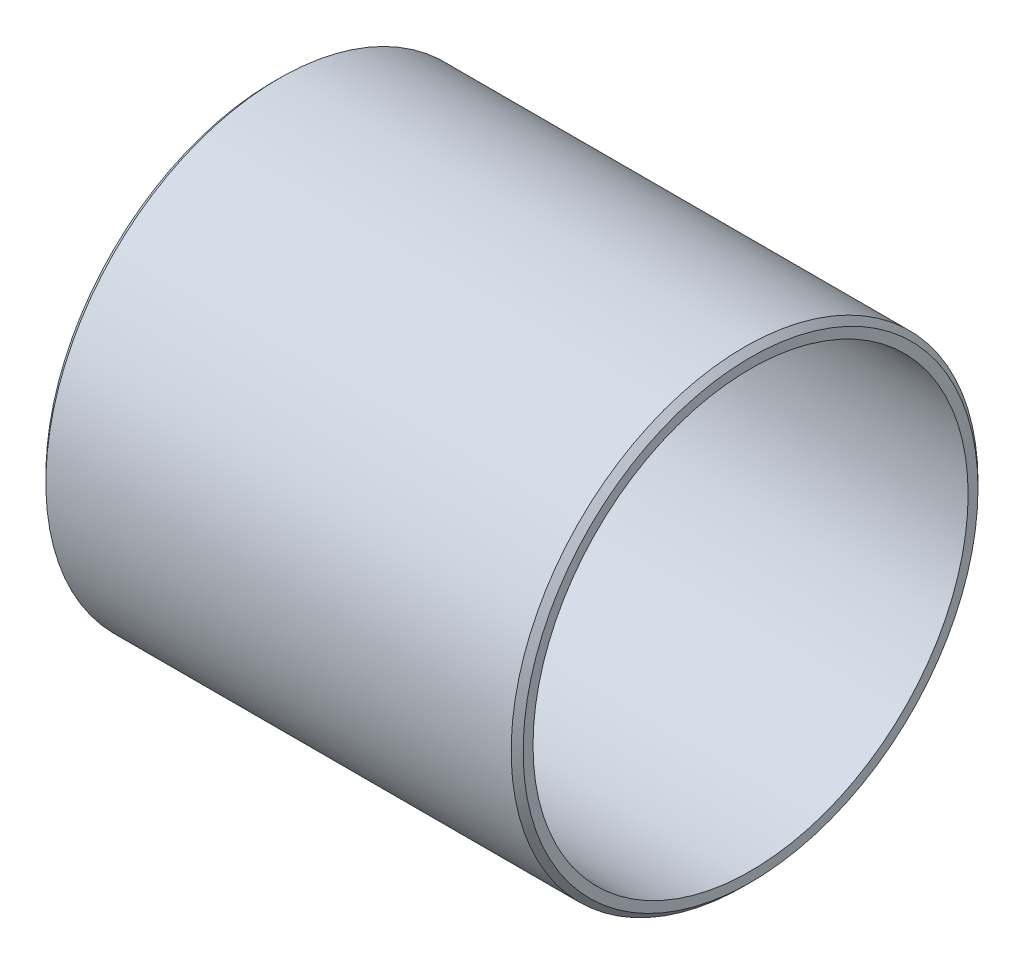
from build123d import *

# Parameters (mm, degrees)
SKETCH1_R           = 30.93085
SKETCH1_R_2         = 28.829
BOSS_EXTRUDE1_DEPTH = 31.623
CHAMFER1_SIZE       = 0.79375


with BuildPart() as part:
    # Sketch1 → Boss-Extrude1 (new, symmetric)
    with BuildSketch(Plane(origin=(0, 0, 0), x_dir=(0, 0, -1), z_dir=(1, 0, 0))):
        Circle(SKETCH1_R)
        Circle(SKETCH1_R_2, mode=Mode.SUBTRACT)
    extrude(amount=BOSS_EXTRUDE1_DEPTH, both=True)

    # Chamfer1
    chamfer1_edges = [part.edges().sort_by_distance(p)[0] for p in [
        (-31.623, 0, 30.93085),
        (31.623, 0, 30.93085),
    ]]
    chamfer(chamfer1_edges, length=CHAMFER1_SIZE)


solid = part.part
